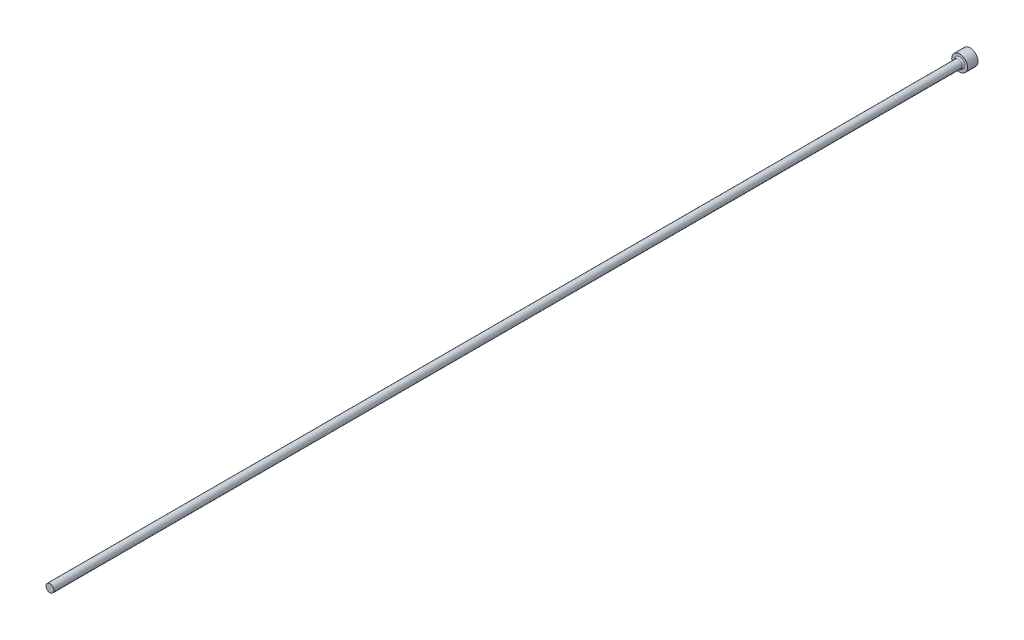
from build123d import *

# Parameters (mm, degrees)
FILLET1_R = 0.5


with BuildPart() as part:
    # FV → Revolve1 (revolve)
    with BuildSketch(Plane(origin=(0, 0, 0), x_dir=(1, 0, 0), z_dir=(0, 1, 0)), mode=Mode.PRIVATE) as revolve1_sk:
        Polygon((0, 0), (3, 0), (3, -4), (1.5, -4), (1.5, -350), (0, -350), align=None)
    revolve(revolve1_sk.sketch.rotate(Axis((0, 0, -9.033228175), (0, 0, 1)), 180), axis=Axis((0, 0, -9.033228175), (0, 0, 1)))

    # Fillet1
    fillet1_edges = [part.edges().sort_by_distance(p)[0] for p in [
        (1.5, 0, 4),
    ]]
    fillet(fillet1_edges, radius=FILLET1_R)


solid = part.part
